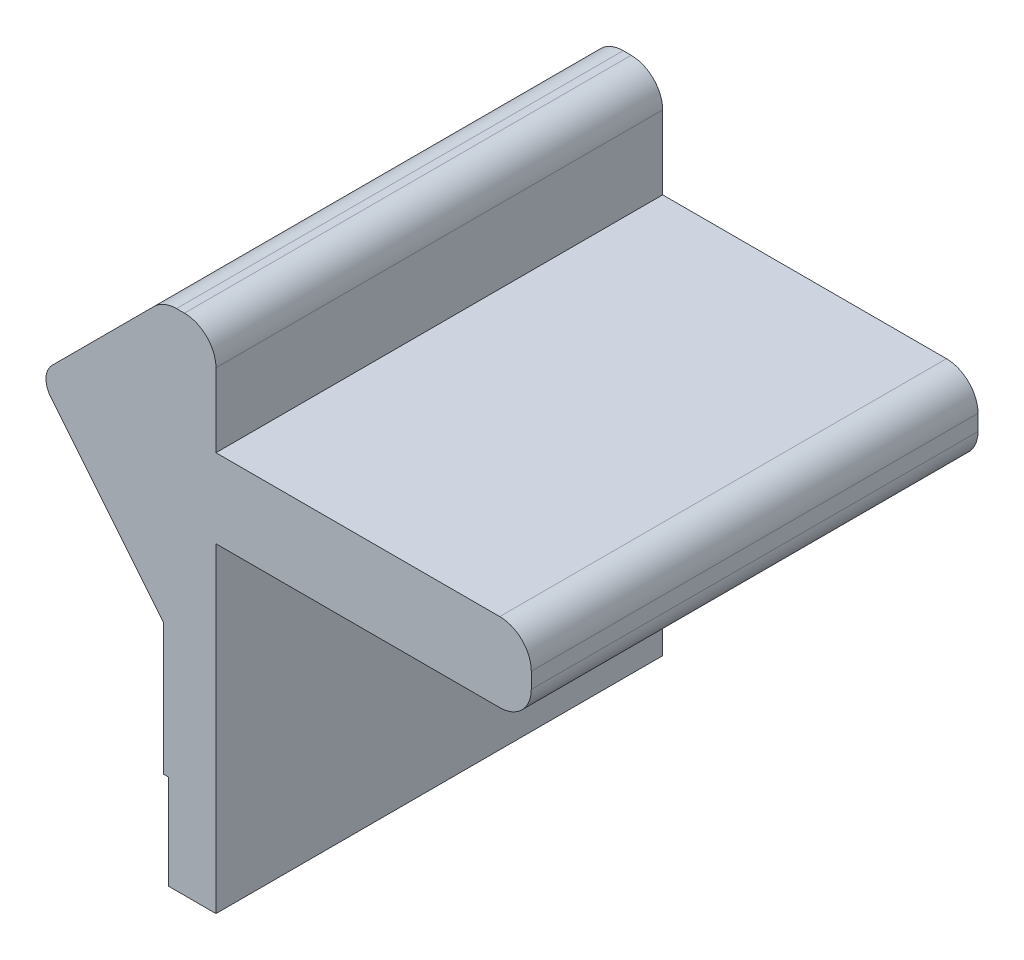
ISO-10303-21;
HEADER;
FILE_DESCRIPTION(('STEP AP214'),'2;1');
FILE_NAME('part.step','',(''),(''),'','','');
FILE_SCHEMA(('AUTOMOTIVE_DESIGN { 1 0 10303 214 1 1 1 1 }'));
ENDSEC;
DATA;
#1=APPLICATION_CONTEXT('core data for automotive mechanical design processes');
#2=APPLICATION_PROTOCOL_DEFINITION('international standard','automotive_design',2000,#1);
#3=PRODUCT_CONTEXT('',#1,'mechanical');
#4=PRODUCT('Part','Part','',(#3));
#5=PRODUCT_RELATED_PRODUCT_CATEGORY('part','',(#4));
#6=PRODUCT_DEFINITION_FORMATION('','',#4);
#7=PRODUCT_DEFINITION_CONTEXT('part definition',#1,'design');
#8=PRODUCT_DEFINITION('design','',#6,#7);
#9=PRODUCT_DEFINITION_SHAPE('','',#8);
#10=(LENGTH_UNIT() NAMED_UNIT(*) SI_UNIT(.MILLI.,.METRE.));
#11=(NAMED_UNIT(*) PLANE_ANGLE_UNIT() SI_UNIT($,.RADIAN.));
#12=(NAMED_UNIT(*) SI_UNIT($,.STERADIAN.) SOLID_ANGLE_UNIT());
#13=UNCERTAINTY_MEASURE_WITH_UNIT(LENGTH_MEASURE(1.E-05),#10,'distance_accuracy_value','');
#14=(GEOMETRIC_REPRESENTATION_CONTEXT(3) GLOBAL_UNCERTAINTY_ASSIGNED_CONTEXT((#13)) GLOBAL_UNIT_ASSIGNED_CONTEXT((#10,
#11,#12)) REPRESENTATION_CONTEXT('',''));
#15=CARTESIAN_POINT('',(0.,0.,0.));
#16=DIRECTION('',(0.,0.,1.));
#17=DIRECTION('',(1.,0.,0.));
#18=AXIS2_PLACEMENT_3D('',#15,#16,#17);
#19=CARTESIAN_POINT('',(-0.999999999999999,0.,-8.5));
#20=DIRECTION('',(1.,0.,0.));
#21=DIRECTION('',(0.,1.,0.));
#22=AXIS2_PLACEMENT_3D('',#19,#20,#21);
#23=PLANE('',#22);
#24=DIRECTION('',(0.,0.,1.));
#25=VECTOR('',#24,1.);
#26=CARTESIAN_POINT('',(-0.999999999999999,4.3,-0.6));
#27=LINE('',#26,#25);
#28=CARTESIAN_POINT('',(-0.999999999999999,4.3,-0.6));
#29=VERTEX_POINT('',#28);
#30=CARTESIAN_POINT('',(-0.999999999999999,4.3,0.));
#31=VERTEX_POINT('',#30);
#32=EDGE_CURVE('E52',#29,#31,#27,.T.);
#33=ORIENTED_EDGE('',*,*,#32,.F.);
#34=DIRECTION('',(0.,1.,0.));
#35=VECTOR('',#34,1.);
#36=CARTESIAN_POINT('',(-0.999999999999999,0.,-0.6));
#37=LINE('',#36,#35);
#38=CARTESIAN_POINT('',(-1.,6.85870739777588,-0.6));
#39=VERTEX_POINT('',#38);
#40=EDGE_CURVE('E57',#29,#39,#37,.T.);
#41=ORIENTED_EDGE('',*,*,#40,.T.);
#42=DIRECTION('',(0.,0.,1.));
#43=VECTOR('',#42,1.);
#44=CARTESIAN_POINT('',(-1.,6.85870739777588,-8.5));
#45=LINE('',#44,#43);
#46=CARTESIAN_POINT('',(-1.,6.85870739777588,-8.5));
#47=VERTEX_POINT('',#46);
#48=EDGE_CURVE('E295',#47,#39,#45,.T.);
#49=ORIENTED_EDGE('',*,*,#48,.F.);
#50=DIRECTION('',(0.,1.,0.));
#51=VECTOR('',#50,1.);
#52=CARTESIAN_POINT('',(-0.999999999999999,0.,-8.5));
#53=LINE('',#52,#51);
#54=CARTESIAN_POINT('',(-0.999999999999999,1.8,-8.5));
#55=VERTEX_POINT('',#54);
#56=EDGE_CURVE('E208',#55,#47,#53,.T.);
#57=ORIENTED_EDGE('',*,*,#56,.F.);
#58=DIRECTION('',(0.,0.,1.));
#59=VECTOR('',#58,1.);
#60=CARTESIAN_POINT('',(-0.999999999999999,1.8,-8.5));
#61=LINE('',#60,#59);
#62=CARTESIAN_POINT('',(-0.999999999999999,1.8,0.));
#63=VERTEX_POINT('',#62);
#64=EDGE_CURVE('E293',#55,#63,#61,.T.);
#65=ORIENTED_EDGE('',*,*,#64,.T.);
#66=DIRECTION('',(0.,1.,0.));
#67=VECTOR('',#66,1.);
#68=CARTESIAN_POINT('',(-0.999999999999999,0.,0.));
#69=LINE('',#68,#67);
#70=EDGE_CURVE('E241',#63,#31,#69,.T.);
#71=ORIENTED_EDGE('',*,*,#70,.T.);
#72=EDGE_LOOP('',(#33,#41,#49,#57,#65,#71));
#73=FACE_BOUND('',#72,.T.);
#74=ADVANCED_FACE('F35',(#73),#23,.F.);
#75=CARTESIAN_POINT('',(-1.2,6.85870739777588,-8.5));
#76=DIRECTION('',(0.,0.,1.));
#77=DIRECTION('',(1.,0.,0.));
#78=AXIS2_PLACEMENT_3D('',#75,#76,#77);
#79=CYLINDRICAL_SURFACE('',#78,0.2);
#80=ORIENTED_EDGE('',*,*,#48,.T.);
#81=CARTESIAN_POINT('',(-1.2,6.85870739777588,-0.6));
#82=DIRECTION('',(0.,0.,1.));
#83=DIRECTION('',(1.,0.,0.));
#84=AXIS2_PLACEMENT_3D('',#81,#82,#83);
#85=CIRCLE('',#84,0.2);
#86=CARTESIAN_POINT('',(-1.23287979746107,7.05598618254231,-0.6));
#87=VERTEX_POINT('',#86);
#88=EDGE_CURVE('E369',#87,#39,#85,.F.);
#89=ORIENTED_EDGE('',*,*,#88,.F.);
#90=DIRECTION('',(0.,0.,1.));
#91=VECTOR('',#90,1.);
#92=CARTESIAN_POINT('',(-1.23287979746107,7.05598618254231,-8.5));
#93=LINE('',#92,#91);
#94=CARTESIAN_POINT('',(-1.23287979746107,7.05598618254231,-8.5));
#95=VERTEX_POINT('',#94);
#96=EDGE_CURVE('E297',#95,#87,#93,.T.);
#97=ORIENTED_EDGE('',*,*,#96,.F.);
#98=CARTESIAN_POINT('',(-1.2,6.85870739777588,-8.5));
#99=DIRECTION('',(0.,0.,1.));
#100=DIRECTION('',(1.,0.,0.));
#101=AXIS2_PLACEMENT_3D('',#98,#99,#100);
#102=CIRCLE('',#101,0.2);
#103=EDGE_CURVE('E205',#95,#47,#102,.F.);
#104=ORIENTED_EDGE('',*,*,#103,.T.);
#105=EDGE_LOOP('',(#80,#89,#97,#104));
#106=FACE_BOUND('',#105,.T.);
#107=ADVANCED_FACE('F367',(#106),#79,.F.);
#108=CARTESIAN_POINT('',(-1.17753505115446,7.06521030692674,-8.5));
#109=DIRECTION('',(-0.164398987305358,0.986393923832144,0.));
#110=DIRECTION('',(-0.986393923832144,-0.164398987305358,0.));
#111=AXIS2_PLACEMENT_3D('',#108,#109,#110);
#112=PLANE('',#111);
#113=DIRECTION('',(-0.986393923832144,-0.164398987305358,0.));
#114=VECTOR('',#113,1.);
#115=CARTESIAN_POINT('',(-1.17753505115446,7.06521030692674,-0.6));
#116=LINE('',#115,#114);
#117=CARTESIAN_POINT('',(-2.76879689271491,6.8,-0.6));
#118=VERTEX_POINT('',#117);
#119=EDGE_CURVE('E373',#87,#118,#116,.T.);
#120=ORIENTED_EDGE('',*,*,#119,.T.);
#121=DIRECTION('',(0.,0.,1.));
#122=VECTOR('',#121,1.);
#123=CARTESIAN_POINT('',(-2.76879689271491,6.8,-8.5));
#124=LINE('',#123,#122);
#125=CARTESIAN_POINT('',(-2.76879689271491,6.8,-8.5));
#126=VERTEX_POINT('',#125);
#127=EDGE_CURVE('E300',#126,#118,#124,.T.);
#128=ORIENTED_EDGE('',*,*,#127,.F.);
#129=DIRECTION('',(-0.986393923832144,-0.164398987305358,0.));
#130=VECTOR('',#129,1.);
#131=CARTESIAN_POINT('',(-1.17753505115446,7.06521030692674,-8.5));
#132=LINE('',#131,#130);
#133=EDGE_CURVE('E203',#95,#126,#132,.T.);
#134=ORIENTED_EDGE('',*,*,#133,.F.);
#135=ORIENTED_EDGE('',*,*,#96,.T.);
#136=EDGE_LOOP('',(#120,#128,#134,#135));
#137=FACE_BOUND('',#136,.T.);
#138=ADVANCED_FACE('F372',(#137),#112,.F.);
#139=CARTESIAN_POINT('',(0.,9.59479948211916,-8.5));
#140=DIRECTION('',(0.,-1.,0.));
#141=DIRECTION('',(0.,0.,-1.));
#142=AXIS2_PLACEMENT_3D('',#139,#140,#141);
#143=PLANE('',#142);
#144=DIRECTION('',(1.,0.,0.));
#145=VECTOR('',#144,1.);
#146=CARTESIAN_POINT('',(0.,9.59479948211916,0.));
#147=LINE('',#146,#145);
#148=CARTESIAN_POINT('',(-0.751471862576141,9.59479948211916,0.));
#149=VERTEX_POINT('',#148);
#150=CARTESIAN_POINT('',(-0.6,9.59479948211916,0.));
#151=VERTEX_POINT('',#150);
#152=EDGE_CURVE('E232',#149,#151,#147,.T.);
#153=ORIENTED_EDGE('',*,*,#152,.T.);
#154=DIRECTION('',(0.,0.,1.));
#155=VECTOR('',#154,1.);
#156=CARTESIAN_POINT('',(-0.6,9.59479948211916,-8.5));
#157=LINE('',#156,#155);
#158=CARTESIAN_POINT('',(-0.6,9.59479948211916,-8.5));
#159=VERTEX_POINT('',#158);
#160=EDGE_CURVE('E11',#159,#151,#157,.T.);
#161=ORIENTED_EDGE('',*,*,#160,.F.);
#162=DIRECTION('',(1.,0.,0.));
#163=VECTOR('',#162,1.);
#164=CARTESIAN_POINT('',(0.,9.59479948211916,-8.5));
#165=LINE('',#164,#163);
#166=CARTESIAN_POINT('',(-0.751471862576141,9.59479948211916,-8.5));
#167=VERTEX_POINT('',#166);
#168=EDGE_CURVE('E187',#167,#159,#165,.T.);
#169=ORIENTED_EDGE('',*,*,#168,.F.);
#170=DIRECTION('',(0.,0.,1.));
#171=VECTOR('',#170,1.);
#172=CARTESIAN_POINT('',(-0.751471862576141,9.59479948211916,-8.5));
#173=LINE('',#172,#171);
#174=EDGE_CURVE('E39',#167,#149,#173,.T.);
#175=ORIENTED_EDGE('',*,*,#174,.T.);
#176=EDGE_LOOP('',(#153,#161,#169,#175));
#177=FACE_BOUND('',#176,.T.);
#178=ADVANCED_FACE('F37',(#177),#143,.F.);
#179=CARTESIAN_POINT('',(-0.6,8.99479948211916,-8.5));
#180=DIRECTION('',(0.,0.,1.));
#181=DIRECTION('',(1.,0.,0.));
#182=AXIS2_PLACEMENT_3D('',#179,#180,#181);
#183=CYLINDRICAL_SURFACE('',#182,0.6);
#184=CARTESIAN_POINT('',(-0.6,8.99479948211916,0.));
#185=DIRECTION('',(0.,0.,1.));
#186=DIRECTION('',(1.,0.,0.));
#187=AXIS2_PLACEMENT_3D('',#184,#185,#186);
#188=CIRCLE('',#187,0.6);
#189=CARTESIAN_POINT('',(0.,8.99479948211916,0.));
#190=VERTEX_POINT('',#189);
#191=EDGE_CURVE('E189',#151,#190,#188,.F.);
#192=ORIENTED_EDGE('',*,*,#191,.T.);
#193=DIRECTION('',(0.,0.,1.));
#194=VECTOR('',#193,1.);
#195=CARTESIAN_POINT('',(0.,8.99479948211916,-8.5));
#196=LINE('',#195,#194);
#197=CARTESIAN_POINT('',(0.,8.99479948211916,-8.5));
#198=VERTEX_POINT('',#197);
#199=EDGE_CURVE('E44',#198,#190,#196,.T.);
#200=ORIENTED_EDGE('',*,*,#199,.F.);
#201=CARTESIAN_POINT('',(-0.6,8.99479948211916,-8.5));
#202=DIRECTION('',(0.,0.,1.));
#203=DIRECTION('',(1.,0.,0.));
#204=AXIS2_PLACEMENT_3D('',#201,#202,#203);
#205=CIRCLE('',#204,0.6);
#206=EDGE_CURVE('E184',#159,#198,#205,.F.);
#207=ORIENTED_EDGE('',*,*,#206,.F.);
#208=ORIENTED_EDGE('',*,*,#160,.T.);
#209=EDGE_LOOP('',(#192,#200,#207,#208));
#210=FACE_BOUND('',#209,.T.);
#211=ADVANCED_FACE('F314',(#210),#183,.T.);
#212=CARTESIAN_POINT('',(0.,0.,-8.5));
#213=DIRECTION('',(-1.,0.,0.));
#214=DIRECTION('',(0.,0.,1.));
#215=AXIS2_PLACEMENT_3D('',#212,#213,#214);
#216=PLANE('',#215);
#217=DIRECTION('',(0.,-1.,0.));
#218=VECTOR('',#217,1.);
#219=CARTESIAN_POINT('',(0.,0.,0.));
#220=LINE('',#219,#218);
#221=CARTESIAN_POINT('',(0.,7.59479948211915,0.));
#222=VERTEX_POINT('',#221);
#223=EDGE_CURVE('E255',#190,#222,#220,.T.);
#224=ORIENTED_EDGE('',*,*,#223,.T.);
#225=DIRECTION('',(0.,0.,1.));
#226=VECTOR('',#225,1.);
#227=CARTESIAN_POINT('',(0.,7.59479948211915,-8.5));
#228=LINE('',#227,#226);
#229=CARTESIAN_POINT('',(0.,7.59479948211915,-8.5));
#230=VERTEX_POINT('',#229);
#231=EDGE_CURVE('E268',#230,#222,#228,.T.);
#232=ORIENTED_EDGE('',*,*,#231,.F.);
#233=DIRECTION('',(0.,-1.,0.));
#234=VECTOR('',#233,1.);
#235=CARTESIAN_POINT('',(0.,0.,-8.5));
#236=LINE('',#235,#234);
#237=EDGE_CURVE('E221',#198,#230,#236,.T.);
#238=ORIENTED_EDGE('',*,*,#237,.F.);
#239=ORIENTED_EDGE('',*,*,#199,.T.);
#240=EDGE_LOOP('',(#224,#232,#238,#239));
#241=FACE_BOUND('',#240,.T.);
#242=ADVANCED_FACE('F320',(#241),#216,.F.);
#243=CARTESIAN_POINT('',(0.,7.59479948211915,-8.5));
#244=DIRECTION('',(0.,-1.,0.));
#245=DIRECTION('',(0.,0.,-1.));
#246=AXIS2_PLACEMENT_3D('',#243,#244,#245);
#247=PLANE('',#246);
#248=DIRECTION('',(1.,0.,0.));
#249=VECTOR('',#248,1.);
#250=CARTESIAN_POINT('',(0.,7.59479948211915,0.));
#251=LINE('',#250,#249);
#252=CARTESIAN_POINT('',(5.4,7.59479948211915,0.));
#253=VERTEX_POINT('',#252);
#254=EDGE_CURVE('E263',#222,#253,#251,.T.);
#255=ORIENTED_EDGE('',*,*,#254,.T.);
#256=DIRECTION('',(0.,0.,1.));
#257=VECTOR('',#256,1.);
#258=CARTESIAN_POINT('',(5.4,7.59479948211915,-8.5));
#259=LINE('',#258,#257);
#260=CARTESIAN_POINT('',(5.4,7.59479948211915,-8.5));
#261=VERTEX_POINT('',#260);
#262=EDGE_CURVE('E271',#261,#253,#259,.T.);
#263=ORIENTED_EDGE('',*,*,#262,.F.);
#264=DIRECTION('',(1.,0.,0.));
#265=VECTOR('',#264,1.);
#266=CARTESIAN_POINT('',(0.,7.59479948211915,-8.5));
#267=LINE('',#266,#265);
#268=EDGE_CURVE('E229',#230,#261,#267,.T.);
#269=ORIENTED_EDGE('',*,*,#268,.F.);
#270=ORIENTED_EDGE('',*,*,#231,.T.);
#271=EDGE_LOOP('',(#255,#263,#269,#270));
#272=FACE_BOUND('',#271,.T.);
#273=ADVANCED_FACE('F322',(#272),#247,.F.);
#274=CARTESIAN_POINT('',(5.4,6.99479948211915,-8.5));
#275=DIRECTION('',(0.,0.,1.));
#276=DIRECTION('',(1.,0.,0.));
#277=AXIS2_PLACEMENT_3D('',#274,#275,#276);
#278=CYLINDRICAL_SURFACE('',#277,0.6);
#279=CARTESIAN_POINT('',(5.4,6.99479948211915,0.));
#280=DIRECTION('',(0.,0.,1.));
#281=DIRECTION('',(1.,0.,0.));
#282=AXIS2_PLACEMENT_3D('',#279,#280,#281);
#283=CIRCLE('',#282,0.6);
#284=CARTESIAN_POINT('',(6.,6.99479948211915,0.));
#285=VERTEX_POINT('',#284);
#286=EDGE_CURVE('E261',#253,#285,#283,.F.);
#287=ORIENTED_EDGE('',*,*,#286,.T.);
#288=DIRECTION('',(0.,0.,1.));
#289=VECTOR('',#288,1.);
#290=CARTESIAN_POINT('',(6.,6.99479948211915,-8.5));
#291=LINE('',#290,#289);
#292=CARTESIAN_POINT('',(6.,6.99479948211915,-8.5));
#293=VERTEX_POINT('',#292);
#294=EDGE_CURVE('E274',#293,#285,#291,.T.);
#295=ORIENTED_EDGE('',*,*,#294,.F.);
#296=CARTESIAN_POINT('',(5.4,6.99479948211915,-8.5));
#297=DIRECTION('',(0.,0.,1.));
#298=DIRECTION('',(1.,0.,0.));
#299=AXIS2_PLACEMENT_3D('',#296,#297,#298);
#300=CIRCLE('',#299,0.6);
#301=EDGE_CURVE('E227',#261,#293,#300,.F.);
#302=ORIENTED_EDGE('',*,*,#301,.F.);
#303=ORIENTED_EDGE('',*,*,#262,.T.);
#304=EDGE_LOOP('',(#287,#295,#302,#303));
#305=FACE_BOUND('',#304,.T.);
#306=ADVANCED_FACE('F327',(#305),#278,.T.);
#307=CARTESIAN_POINT('',(5.99999999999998,0.,-8.5));
#308=DIRECTION('',(-1.,0.,0.));
#309=DIRECTION('',(0.,-1.,0.));
#310=AXIS2_PLACEMENT_3D('',#307,#308,#309);
#311=PLANE('',#310);
#312=DIRECTION('',(0.,-1.,0.));
#313=VECTOR('',#312,1.);
#314=CARTESIAN_POINT('',(5.99999999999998,0.,0.));
#315=LINE('',#314,#313);
#316=CARTESIAN_POINT('',(6.,6.69479948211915,0.));
#317=VERTEX_POINT('',#316);
#318=EDGE_CURVE('E259',#285,#317,#315,.T.);
#319=ORIENTED_EDGE('',*,*,#318,.T.);
#320=DIRECTION('',(0.,0.,1.));
#321=VECTOR('',#320,1.);
#322=CARTESIAN_POINT('',(6.,6.69479948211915,-8.5));
#323=LINE('',#322,#321);
#324=CARTESIAN_POINT('',(6.,6.69479948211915,-8.5));
#325=VERTEX_POINT('',#324);
#326=EDGE_CURVE('E277',#325,#317,#323,.T.);
#327=ORIENTED_EDGE('',*,*,#326,.F.);
#328=DIRECTION('',(0.,-1.,0.));
#329=VECTOR('',#328,1.);
#330=CARTESIAN_POINT('',(5.99999999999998,0.,-8.5));
#331=LINE('',#330,#329);
#332=EDGE_CURVE('E225',#293,#325,#331,.T.);
#333=ORIENTED_EDGE('',*,*,#332,.F.);
#334=ORIENTED_EDGE('',*,*,#294,.T.);
#335=EDGE_LOOP('',(#319,#327,#333,#334));
#336=FACE_BOUND('',#335,.T.);
#337=ADVANCED_FACE('F333',(#336),#311,.F.);
#338=CARTESIAN_POINT('',(5.4,6.69479948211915,-8.5));
#339=DIRECTION('',(0.,0.,1.));
#340=DIRECTION('',(1.,0.,0.));
#341=AXIS2_PLACEMENT_3D('',#338,#339,#340);
#342=CYLINDRICAL_SURFACE('',#341,0.6);
#343=CARTESIAN_POINT('',(5.4,6.69479948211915,0.));
#344=DIRECTION('',(0.,0.,1.));
#345=DIRECTION('',(1.,0.,0.));
#346=AXIS2_PLACEMENT_3D('',#343,#344,#345);
#347=CIRCLE('',#346,0.6);
#348=CARTESIAN_POINT('',(5.4,6.09479948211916,0.));
#349=VERTEX_POINT('',#348);
#350=EDGE_CURVE('E257',#317,#349,#347,.F.);
#351=ORIENTED_EDGE('',*,*,#350,.T.);
#352=DIRECTION('',(0.,0.,1.));
#353=VECTOR('',#352,1.);
#354=CARTESIAN_POINT('',(5.4,6.09479948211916,-8.5));
#355=LINE('',#354,#353);
#356=CARTESIAN_POINT('',(5.4,6.09479948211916,-8.5));
#357=VERTEX_POINT('',#356);
#358=EDGE_CURVE('E280',#357,#349,#355,.T.);
#359=ORIENTED_EDGE('',*,*,#358,.F.);
#360=CARTESIAN_POINT('',(5.4,6.69479948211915,-8.5));
#361=DIRECTION('',(0.,0.,1.));
#362=DIRECTION('',(1.,0.,0.));
#363=AXIS2_PLACEMENT_3D('',#360,#361,#362);
#364=CIRCLE('',#363,0.6);
#365=EDGE_CURVE('E223',#325,#357,#364,.F.);
#366=ORIENTED_EDGE('',*,*,#365,.F.);
#367=ORIENTED_EDGE('',*,*,#326,.T.);
#368=EDGE_LOOP('',(#351,#359,#366,#367));
#369=FACE_BOUND('',#368,.T.);
#370=ADVANCED_FACE('F337',(#369),#342,.T.);
#371=CARTESIAN_POINT('',(0.,6.09479948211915,-8.5));
#372=DIRECTION('',(0.,1.,0.));
#373=DIRECTION('',(-1.,0.,0.));
#374=AXIS2_PLACEMENT_3D('',#371,#372,#373);
#375=PLANE('',#374);
#376=DIRECTION('',(-1.,0.,0.));
#377=VECTOR('',#376,1.);
#378=CARTESIAN_POINT('',(0.,6.09479948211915,0.));
#379=LINE('',#378,#377);
#380=CARTESIAN_POINT('',(0.,6.09479948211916,0.));
#381=VERTEX_POINT('',#380);
#382=EDGE_CURVE('E254',#349,#381,#379,.T.);
#383=ORIENTED_EDGE('',*,*,#382,.T.);
#384=DIRECTION('',(0.,0.,1.));
#385=VECTOR('',#384,1.);
#386=CARTESIAN_POINT('',(0.,6.09479948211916,-8.5));
#387=LINE('',#386,#385);
#388=CARTESIAN_POINT('',(0.,6.09479948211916,-8.5));
#389=VERTEX_POINT('',#388);
#390=EDGE_CURVE('E283',#389,#381,#387,.T.);
#391=ORIENTED_EDGE('',*,*,#390,.F.);
#392=DIRECTION('',(-1.,0.,0.));
#393=VECTOR('',#392,1.);
#394=CARTESIAN_POINT('',(0.,6.09479948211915,-8.5));
#395=LINE('',#394,#393);
#396=EDGE_CURVE('E220',#357,#389,#395,.T.);
#397=ORIENTED_EDGE('',*,*,#396,.F.);
#398=ORIENTED_EDGE('',*,*,#358,.T.);
#399=EDGE_LOOP('',(#383,#391,#397,#398));
#400=FACE_BOUND('',#399,.T.);
#401=ADVANCED_FACE('F342',(#400),#375,.F.);
#402=CARTESIAN_POINT('',(0.,0.,0.));
#403=VERTEX_POINT('',#402);
#404=EDGE_CURVE('E252',#381,#403,#220,.T.);
#405=ORIENTED_EDGE('',*,*,#404,.T.);
#406=DIRECTION('',(0.,0.,1.));
#407=VECTOR('',#406,1.);
#408=CARTESIAN_POINT('',(0.,0.,-8.5));
#409=LINE('',#408,#407);
#410=CARTESIAN_POINT('',(0.,0.,-8.5));
#411=VERTEX_POINT('',#410);
#412=EDGE_CURVE('E286',#411,#403,#409,.T.);
#413=ORIENTED_EDGE('',*,*,#412,.F.);
#414=EDGE_CURVE('E218',#389,#411,#236,.T.);
#415=ORIENTED_EDGE('',*,*,#414,.F.);
#416=ORIENTED_EDGE('',*,*,#390,.T.);
#417=EDGE_LOOP('',(#405,#413,#415,#416));
#418=FACE_BOUND('',#417,.T.);
#419=ADVANCED_FACE('F349',(#418),#216,.F.);
#420=CARTESIAN_POINT('',(0.,0.,-8.5));
#421=DIRECTION('',(0.,1.,0.));
#422=DIRECTION('',(0.,0.,1.));
#423=AXIS2_PLACEMENT_3D('',#420,#421,#422);
#424=PLANE('',#423);
#425=DIRECTION('',(-1.,0.,0.));
#426=VECTOR('',#425,1.);
#427=CARTESIAN_POINT('',(0.,0.,0.));
#428=LINE('',#427,#426);
#429=CARTESIAN_POINT('',(-0.900000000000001,0.,0.));
#430=VERTEX_POINT('',#429);
#431=EDGE_CURVE('E249',#403,#430,#428,.T.);
#432=ORIENTED_EDGE('',*,*,#431,.T.);
#433=DIRECTION('',(0.,0.,1.));
#434=VECTOR('',#433,1.);
#435=CARTESIAN_POINT('',(-0.900000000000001,0.,-8.5));
#436=LINE('',#435,#434);
#437=CARTESIAN_POINT('',(-0.900000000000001,0.,-8.5));
#438=VERTEX_POINT('',#437);
#439=EDGE_CURVE('E289',#438,#430,#436,.T.);
#440=ORIENTED_EDGE('',*,*,#439,.F.);
#441=DIRECTION('',(-1.,0.,0.));
#442=VECTOR('',#441,1.);
#443=CARTESIAN_POINT('',(0.,0.,-8.5));
#444=LINE('',#443,#442);
#445=EDGE_CURVE('E216',#411,#438,#444,.T.);
#446=ORIENTED_EDGE('',*,*,#445,.F.);
#447=ORIENTED_EDGE('',*,*,#412,.T.);
#448=EDGE_LOOP('',(#432,#440,#446,#447));
#449=FACE_BOUND('',#448,.T.);
#450=ADVANCED_FACE('F353',(#449),#424,.F.);
#451=CARTESIAN_POINT('',(-0.900000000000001,0.,-8.5));
#452=DIRECTION('',(-1.,0.,0.));
#453=DIRECTION('',(0.,-1.,0.));
#454=AXIS2_PLACEMENT_3D('',#451,#452,#453);
#455=PLANE('',#454);
#456=DIRECTION('',(0.,-1.,0.));
#457=VECTOR('',#456,1.);
#458=CARTESIAN_POINT('',(-0.900000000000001,0.,0.));
#459=LINE('',#458,#457);
#460=CARTESIAN_POINT('',(-0.900000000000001,1.8,0.));
#461=VERTEX_POINT('',#460);
#462=EDGE_CURVE('E246',#461,#430,#459,.T.);
#463=ORIENTED_EDGE('',*,*,#462,.F.);
#464=DIRECTION('',(0.,0.,1.));
#465=VECTOR('',#464,1.);
#466=CARTESIAN_POINT('',(-0.900000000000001,1.8,-8.5));
#467=LINE('',#466,#465);
#468=CARTESIAN_POINT('',(-0.900000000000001,1.8,-8.5));
#469=VERTEX_POINT('',#468);
#470=EDGE_CURVE('E291',#469,#461,#467,.T.);
#471=ORIENTED_EDGE('',*,*,#470,.F.);
#472=DIRECTION('',(0.,-1.,0.));
#473=VECTOR('',#472,1.);
#474=CARTESIAN_POINT('',(-0.900000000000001,0.,-8.5));
#475=LINE('',#474,#473);
#476=EDGE_CURVE('E213',#469,#438,#475,.T.);
#477=ORIENTED_EDGE('',*,*,#476,.T.);
#478=ORIENTED_EDGE('',*,*,#439,.T.);
#479=EDGE_LOOP('',(#463,#471,#477,#478));
#480=FACE_BOUND('',#479,.T.);
#481=ADVANCED_FACE('F356',(#480),#455,.T.);
#482=CARTESIAN_POINT('',(0.,1.8,-8.5));
#483=DIRECTION('',(0.,-1.,0.));
#484=DIRECTION('',(0.,0.,-1.));
#485=AXIS2_PLACEMENT_3D('',#482,#483,#484);
#486=PLANE('',#485);
#487=DIRECTION('',(1.,0.,0.));
#488=VECTOR('',#487,1.);
#489=CARTESIAN_POINT('',(0.,1.8,0.));
#490=LINE('',#489,#488);
#491=EDGE_CURVE('E243',#63,#461,#490,.T.);
#492=ORIENTED_EDGE('',*,*,#491,.F.);
#493=ORIENTED_EDGE('',*,*,#64,.F.);
#494=DIRECTION('',(1.,0.,0.));
#495=VECTOR('',#494,1.);
#496=CARTESIAN_POINT('',(0.,1.8,-8.5));
#497=LINE('',#496,#495);
#498=EDGE_CURVE('E210',#55,#469,#497,.T.);
#499=ORIENTED_EDGE('',*,*,#498,.T.);
#500=ORIENTED_EDGE('',*,*,#470,.T.);
#501=EDGE_LOOP('',(#492,#493,#499,#500));
#502=FACE_BOUND('',#501,.T.);
#503=ADVANCED_FACE('F360',(#502),#486,.T.);
#504=CARTESIAN_POINT('',(-2.83455648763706,7.19455756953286,-8.5));
#505=DIRECTION('',(0.,0.,1.));
#506=DIRECTION('',(1.,0.,0.));
#507=AXIS2_PLACEMENT_3D('',#504,#505,#506);
#508=CYLINDRICAL_SURFACE('',#507,0.400000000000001);
#509=DIRECTION('',(0.,0.,1.));
#510=VECTOR('',#509,1.);
#511=CARTESIAN_POINT('',(-3.14511038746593,6.94245387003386,-0.6));
#512=LINE('',#511,#510);
#513=CARTESIAN_POINT('',(-3.14511038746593,6.94245387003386,-0.6));
#514=VERTEX_POINT('',#513);
#515=CARTESIAN_POINT('',(-3.14511038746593,6.94245387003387,0.));
#516=VERTEX_POINT('',#515);
#517=EDGE_CURVE('E378',#514,#516,#512,.T.);
#518=ORIENTED_EDGE('',*,*,#517,.T.);
#519=CARTESIAN_POINT('',(-2.83455648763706,7.19455756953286,0.));
#520=DIRECTION('',(0.,0.,1.));
#521=DIRECTION('',(1.,0.,0.));
#522=AXIS2_PLACEMENT_3D('',#519,#520,#521);
#523=CIRCLE('',#522,0.400000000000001);
#524=CARTESIAN_POINT('',(-3.11739920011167,7.47740028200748,0.));
#525=VERTEX_POINT('',#524);
#526=EDGE_CURVE('E238',#525,#516,#523,.T.);
#527=ORIENTED_EDGE('',*,*,#526,.F.);
#528=DIRECTION('',(0.,0.,1.));
#529=VECTOR('',#528,1.);
#530=CARTESIAN_POINT('',(-3.11739920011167,7.47740028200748,-8.5));
#531=LINE('',#530,#529);
#532=CARTESIAN_POINT('',(-3.11739920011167,7.47740028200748,-8.5));
#533=VERTEX_POINT('',#532);
#534=EDGE_CURVE('E303',#533,#525,#531,.T.);
#535=ORIENTED_EDGE('',*,*,#534,.F.);
#536=CARTESIAN_POINT('',(-2.83455648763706,7.19455756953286,-8.5));
#537=DIRECTION('',(0.,0.,1.));
#538=DIRECTION('',(1.,0.,0.));
#539=AXIS2_PLACEMENT_3D('',#536,#537,#538);
#540=CIRCLE('',#539,0.400000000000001);
#541=EDGE_CURVE('E197',#533,#126,#540,.T.);
#542=ORIENTED_EDGE('',*,*,#541,.T.);
#543=ORIENTED_EDGE('',*,*,#127,.T.);
#544=CARTESIAN_POINT('',(-2.83455648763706,7.19455756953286,-0.6));
#545=DIRECTION('',(0.,0.,1.));
#546=DIRECTION('',(1.,0.,0.));
#547=AXIS2_PLACEMENT_3D('',#544,#545,#546);
#548=CIRCLE('',#547,0.400000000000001);
#549=EDGE_CURVE('E391',#514,#118,#548,.T.);
#550=ORIENTED_EDGE('',*,*,#549,.F.);
#551=EDGE_LOOP('',(#518,#527,#535,#542,#543,#550));
#552=FACE_BOUND('',#551,.T.);
#553=ADVANCED_FACE('F376',(#552),#508,.T.);
#554=CARTESIAN_POINT('',(-5.29739974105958,5.29739974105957,-8.5));
#555=DIRECTION('',(-0.707106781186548,0.707106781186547,0.));
#556=DIRECTION('',(-0.707106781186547,-0.707106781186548,0.));
#557=AXIS2_PLACEMENT_3D('',#554,#555,#556);
#558=PLANE('',#557);
#559=DIRECTION('',(-0.707106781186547,-0.707106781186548,0.));
#560=VECTOR('',#559,1.);
#561=CARTESIAN_POINT('',(-5.29739974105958,5.29739974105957,0.));
#562=LINE('',#561,#560);
#563=CARTESIAN_POINT('',(-1.17573593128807,9.41906355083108,0.));
#564=VERTEX_POINT('',#563);
#565=EDGE_CURVE('E235',#564,#525,#562,.T.);
#566=ORIENTED_EDGE('',*,*,#565,.F.);
#567=DIRECTION('',(0.,0.,1.));
#568=VECTOR('',#567,1.);
#569=CARTESIAN_POINT('',(-1.17573593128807,9.41906355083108,-8.5));
#570=LINE('',#569,#568);
#571=CARTESIAN_POINT('',(-1.17573593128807,9.41906355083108,-8.5));
#572=VERTEX_POINT('',#571);
#573=EDGE_CURVE('E183',#572,#564,#570,.T.);
#574=ORIENTED_EDGE('',*,*,#573,.F.);
#575=DIRECTION('',(-0.707106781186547,-0.707106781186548,0.));
#576=VECTOR('',#575,1.);
#577=CARTESIAN_POINT('',(-5.29739974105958,5.29739974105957,-8.5));
#578=LINE('',#577,#576);
#579=EDGE_CURVE('E195',#572,#533,#578,.T.);
#580=ORIENTED_EDGE('',*,*,#579,.T.);
#581=ORIENTED_EDGE('',*,*,#534,.T.);
#582=EDGE_LOOP('',(#566,#574,#580,#581));
#583=FACE_BOUND('',#582,.T.);
#584=ADVANCED_FACE('F306',(#583),#558,.T.);
#585=CARTESIAN_POINT('',(-0.751471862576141,8.99479948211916,-8.5));
#586=DIRECTION('',(0.,0.,1.));
#587=DIRECTION('',(1.,0.,0.));
#588=AXIS2_PLACEMENT_3D('',#585,#586,#587);
#589=CYLINDRICAL_SURFACE('',#588,0.6);
#590=CARTESIAN_POINT('',(-0.751471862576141,8.99479948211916,0.));
#591=DIRECTION('',(0.,0.,1.));
#592=DIRECTION('',(1.,0.,0.));
#593=AXIS2_PLACEMENT_3D('',#590,#591,#592);
#594=CIRCLE('',#593,0.6);
#595=EDGE_CURVE('E179',#149,#564,#594,.T.);
#596=ORIENTED_EDGE('',*,*,#595,.F.);
#597=ORIENTED_EDGE('',*,*,#174,.F.);
#598=CARTESIAN_POINT('',(-0.751471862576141,8.99479948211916,-8.5));
#599=DIRECTION('',(0.,0.,1.));
#600=DIRECTION('',(1.,0.,0.));
#601=AXIS2_PLACEMENT_3D('',#598,#599,#600);
#602=CIRCLE('',#601,0.6);
#603=EDGE_CURVE('E177',#167,#572,#602,.T.);
#604=ORIENTED_EDGE('',*,*,#603,.T.);
#605=ORIENTED_EDGE('',*,*,#573,.T.);
#606=EDGE_LOOP('',(#596,#597,#604,#605));
#607=FACE_BOUND('',#606,.T.);
#608=ADVANCED_FACE('F175',(#607),#589,.T.);
#609=CARTESIAN_POINT('',(0.,0.,-8.5));
#610=DIRECTION('',(0.,0.,1.));
#611=DIRECTION('',(1.,0.,0.));
#612=AXIS2_PLACEMENT_3D('',#609,#610,#611);
#613=PLANE('',#612);
#614=ORIENTED_EDGE('',*,*,#168,.T.);
#615=ORIENTED_EDGE('',*,*,#206,.T.);
#616=ORIENTED_EDGE('',*,*,#237,.T.);
#617=ORIENTED_EDGE('',*,*,#268,.T.);
#618=ORIENTED_EDGE('',*,*,#301,.T.);
#619=ORIENTED_EDGE('',*,*,#332,.T.);
#620=ORIENTED_EDGE('',*,*,#365,.T.);
#621=ORIENTED_EDGE('',*,*,#396,.T.);
#622=ORIENTED_EDGE('',*,*,#414,.T.);
#623=ORIENTED_EDGE('',*,*,#445,.T.);
#624=ORIENTED_EDGE('',*,*,#476,.F.);
#625=ORIENTED_EDGE('',*,*,#498,.F.);
#626=ORIENTED_EDGE('',*,*,#56,.T.);
#627=ORIENTED_EDGE('',*,*,#103,.F.);
#628=ORIENTED_EDGE('',*,*,#133,.T.);
#629=ORIENTED_EDGE('',*,*,#541,.F.);
#630=ORIENTED_EDGE('',*,*,#579,.F.);
#631=ORIENTED_EDGE('',*,*,#603,.F.);
#632=EDGE_LOOP('',(#614,#615,#616,#617,#618,#619,#620,#621,#622,#623,#624,#625,#626,#627,#628,
#629,#630,#631));
#633=FACE_BOUND('',#632,.T.);
#634=ADVANCED_FACE('F192',(#633),#613,.F.);
#635=CARTESIAN_POINT('',(0.,0.,0.));
#636=DIRECTION('',(0.,0.,1.));
#637=DIRECTION('',(1.,0.,0.));
#638=AXIS2_PLACEMENT_3D('',#635,#636,#637);
#639=PLANE('',#638);
#640=ORIENTED_EDGE('',*,*,#152,.F.);
#641=ORIENTED_EDGE('',*,*,#595,.T.);
#642=ORIENTED_EDGE('',*,*,#565,.T.);
#643=ORIENTED_EDGE('',*,*,#526,.T.);
#644=DIRECTION('',(-0.630259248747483,0.776384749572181,0.));
#645=VECTOR('',#644,1.);
#646=CARTESIAN_POINT('',(1.50131849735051,1.21875122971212,0.));
#647=LINE('',#646,#645);
#648=EDGE_CURVE('E381',#31,#516,#647,.T.);
#649=ORIENTED_EDGE('',*,*,#648,.F.);
#650=ORIENTED_EDGE('',*,*,#70,.F.);
#651=ORIENTED_EDGE('',*,*,#491,.T.);
#652=ORIENTED_EDGE('',*,*,#462,.T.);
#653=ORIENTED_EDGE('',*,*,#431,.F.);
#654=ORIENTED_EDGE('',*,*,#404,.F.);
#655=ORIENTED_EDGE('',*,*,#382,.F.);
#656=ORIENTED_EDGE('',*,*,#350,.F.);
#657=ORIENTED_EDGE('',*,*,#318,.F.);
#658=ORIENTED_EDGE('',*,*,#286,.F.);
#659=ORIENTED_EDGE('',*,*,#254,.F.);
#660=ORIENTED_EDGE('',*,*,#223,.F.);
#661=ORIENTED_EDGE('',*,*,#191,.F.);
#662=EDGE_LOOP('',(#640,#641,#642,#643,#649,#650,#651,#652,#653,#654,#655,#656,#657,#658,#659,
#660,#661));
#663=FACE_BOUND('',#662,.T.);
#664=ADVANCED_FACE('F309',(#663),#639,.T.);
#665=CARTESIAN_POINT('',(1.50131849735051,1.21875122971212,-0.6));
#666=DIRECTION('',(0.776384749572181,0.630259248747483,0.));
#667=DIRECTION('',(-0.630259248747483,0.776384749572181,0.));
#668=AXIS2_PLACEMENT_3D('',#665,#666,#667);
#669=PLANE('',#668);
#670=ORIENTED_EDGE('',*,*,#648,.T.);
#671=ORIENTED_EDGE('',*,*,#517,.F.);
#672=DIRECTION('',(-0.630259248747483,0.776384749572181,0.));
#673=VECTOR('',#672,1.);
#674=CARTESIAN_POINT('',(1.50131849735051,1.21875122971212,-0.6));
#675=LINE('',#674,#673);
#676=EDGE_CURVE('E389',#29,#514,#675,.T.);
#677=ORIENTED_EDGE('',*,*,#676,.F.);
#678=ORIENTED_EDGE('',*,*,#32,.T.);
#679=EDGE_LOOP('',(#670,#671,#677,#678));
#680=FACE_BOUND('',#679,.T.);
#681=ADVANCED_FACE('F383',(#680),#669,.F.);
#682=CARTESIAN_POINT('',(0.,0.,-0.6));
#683=DIRECTION('',(0.,0.,1.));
#684=DIRECTION('',(1.,0.,0.));
#685=AXIS2_PLACEMENT_3D('',#682,#683,#684);
#686=PLANE('',#685);
#687=ORIENTED_EDGE('',*,*,#88,.T.);
#688=ORIENTED_EDGE('',*,*,#40,.F.);
#689=ORIENTED_EDGE('',*,*,#676,.T.);
#690=ORIENTED_EDGE('',*,*,#549,.T.);
#691=ORIENTED_EDGE('',*,*,#119,.F.);
#692=EDGE_LOOP('',(#687,#688,#689,#690,#691));
#693=FACE_BOUND('',#692,.T.);
#694=ADVANCED_FACE('F395',(#693),#686,.F.);
#695=CLOSED_SHELL('',(#74,#107,#138,#178,#211,#242,#273,#306,#337,#370,#401,#419,#450,#481,#503,
#553,#584,#608,#634,#664,#681,#694));
#696=MANIFOLD_SOLID_BREP('B2',#695);
#697=ADVANCED_BREP_SHAPE_REPRESENTATION('',(#18,#696),#14);
#698=SHAPE_DEFINITION_REPRESENTATION(#9,#697);
ENDSEC;
END-ISO-10303-21;
